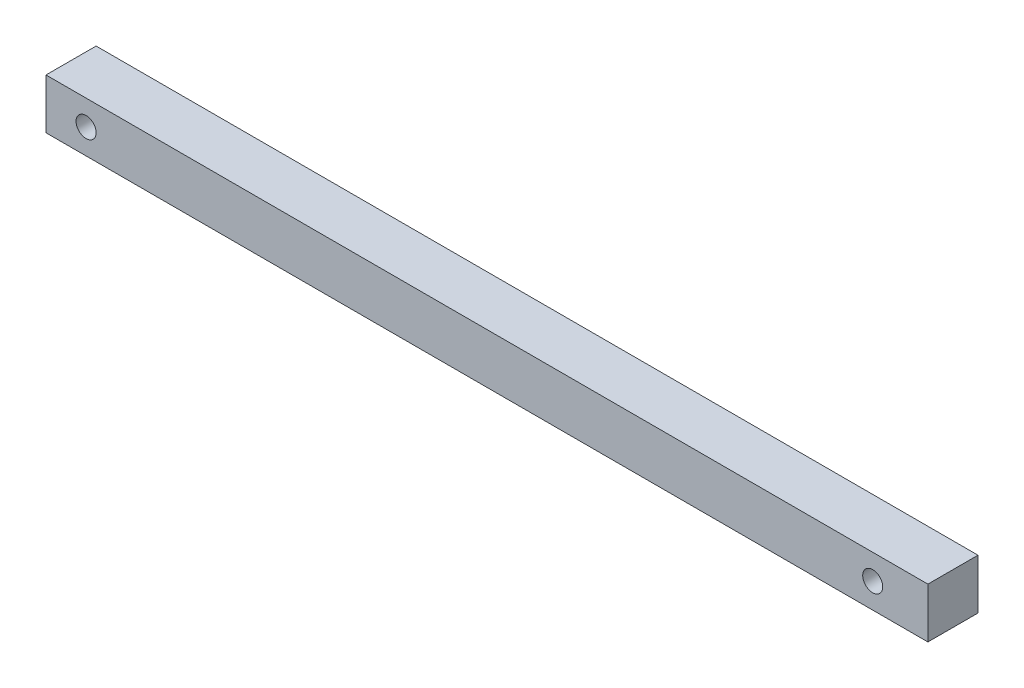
from build123d import *

# Parameters (mm, degrees)
SKETCH1_W           = 88
SKETCH1_H           = 5
BOSS_EXTRUDE1_DEPTH = 5
SKETCH2_R           = 1
CUT_EXTRUDE1_DEPTH  = 5


with BuildPart() as part:
    # Sketch1 → Boss-Extrude1 (new body)
    with BuildSketch(Plane.XY):
        with Locations((-6, 0)):
            Rectangle(SKETCH1_W, SKETCH1_H)
    extrude(amount=BOSS_EXTRUDE1_DEPTH)

    # Sketch2 → Cut-Extrude1 (cut)
    with BuildSketch(Plane.XY.offset(5)):
        with Locations((-46, 0)):
            Circle(SKETCH2_R)
        with Locations((32.494807, 0)):
            Circle(SKETCH2_R)
    extrude(amount=-CUT_EXTRUDE1_DEPTH, mode=Mode.SUBTRACT)


solid = part.part
